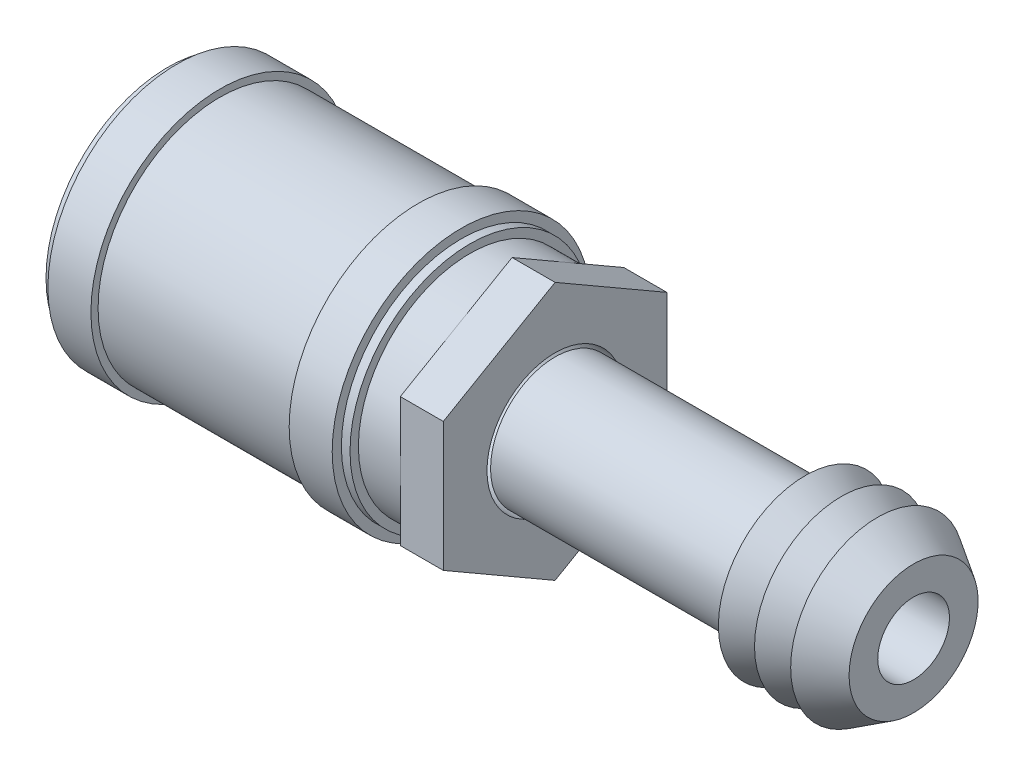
ISO-10303-21;
HEADER;
FILE_DESCRIPTION(('STEP AP214'),'2;1');
FILE_NAME('part.step','',(''),(''),'','','');
FILE_SCHEMA(('AUTOMOTIVE_DESIGN { 1 0 10303 214 1 1 1 1 }'));
ENDSEC;
DATA;
#1=APPLICATION_CONTEXT('core data for automotive mechanical design processes');
#2=APPLICATION_PROTOCOL_DEFINITION('international standard','automotive_design',2000,#1);
#3=PRODUCT_CONTEXT('',#1,'mechanical');
#4=PRODUCT('Part','Part','',(#3));
#5=PRODUCT_RELATED_PRODUCT_CATEGORY('part','',(#4));
#6=PRODUCT_DEFINITION_FORMATION('','',#4);
#7=PRODUCT_DEFINITION_CONTEXT('part definition',#1,'design');
#8=PRODUCT_DEFINITION('design','',#6,#7);
#9=PRODUCT_DEFINITION_SHAPE('','',#8);
#10=(LENGTH_UNIT() NAMED_UNIT(*) SI_UNIT(.MILLI.,.METRE.));
#11=(NAMED_UNIT(*) PLANE_ANGLE_UNIT() SI_UNIT($,.RADIAN.));
#12=(NAMED_UNIT(*) SI_UNIT($,.STERADIAN.) SOLID_ANGLE_UNIT());
#13=UNCERTAINTY_MEASURE_WITH_UNIT(LENGTH_MEASURE(1.E-05),#10,'distance_accuracy_value','');
#14=(GEOMETRIC_REPRESENTATION_CONTEXT(3) GLOBAL_UNCERTAINTY_ASSIGNED_CONTEXT((#13)) GLOBAL_UNIT_ASSIGNED_CONTEXT((#10,
#11,#12)) REPRESENTATION_CONTEXT('',''));
#15=CARTESIAN_POINT('',(0.,0.,0.));
#16=DIRECTION('',(0.,0.,1.));
#17=DIRECTION('',(1.,0.,0.));
#18=AXIS2_PLACEMENT_3D('',#15,#16,#17);
#19=CARTESIAN_POINT('',(0.,0.,0.));
#20=DIRECTION('',(-1.,0.,0.));
#21=DIRECTION('',(0.,0.,1.));
#22=AXIS2_PLACEMENT_3D('',#19,#20,#21);
#23=CYLINDRICAL_SURFACE('',#22,4.75);
#24=CARTESIAN_POINT('',(0.,0.,0.));
#25=DIRECTION('',(-1.,0.,0.));
#26=DIRECTION('',(0.,0.,1.));
#27=AXIS2_PLACEMENT_3D('',#24,#25,#26);
#28=CIRCLE('',#27,4.75);
#29=CARTESIAN_POINT('',(0.,0.,4.75));
#30=VERTEX_POINT('',#29);
#31=EDGE_CURVE('P0_E123',#30,#30,#28,.T.);
#32=ORIENTED_EDGE('',*,*,#31,.T.);
#33=EDGE_LOOP('',(#32));
#34=FACE_BOUND('',#33,.T.);
#35=CARTESIAN_POINT('',(27.,0.,0.));
#36=DIRECTION('',(1.,0.,0.));
#37=DIRECTION('',(0.,0.,-1.));
#38=AXIS2_PLACEMENT_3D('',#35,#36,#37);
#39=CIRCLE('',#38,4.75);
#40=CARTESIAN_POINT('',(27.,0.,-4.75));
#41=VERTEX_POINT('',#40);
#42=EDGE_CURVE('P0_E107',#41,#41,#39,.T.);
#43=ORIENTED_EDGE('',*,*,#42,.T.);
#44=EDGE_LOOP('',(#43));
#45=FACE_BOUND('',#44,.T.);
#46=ADVANCED_FACE('P0_F16',(#34,#45),#23,.F.);
#47=CARTESIAN_POINT('',(0.,0.,0.));
#48=DIRECTION('',(-1.,0.,0.));
#49=DIRECTION('',(0.,0.,1.));
#50=AXIS2_PLACEMENT_3D('',#47,#48,#49);
#51=CYLINDRICAL_SURFACE('',#50,7.77632073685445);
#52=CARTESIAN_POINT('',(21.0601182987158,0.,0.));
#53=DIRECTION('',(-1.,0.,0.));
#54=DIRECTION('',(0.,0.,1.));
#55=AXIS2_PLACEMENT_3D('',#52,#53,#54);
#56=CIRCLE('',#55,7.77632073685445);
#57=CARTESIAN_POINT('',(21.0601182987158,0.,7.77632073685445));
#58=VERTEX_POINT('',#57);
#59=EDGE_CURVE('P0_E10',#58,#58,#56,.T.);
#60=ORIENTED_EDGE('',*,*,#59,.F.);
#61=EDGE_LOOP('',(#60));
#62=FACE_BOUND('',#61,.T.);
#63=CARTESIAN_POINT('',(24.,0.,0.));
#64=DIRECTION('',(-1.,0.,0.));
#65=DIRECTION('',(0.,0.,1.));
#66=AXIS2_PLACEMENT_3D('',#63,#64,#65);
#67=CIRCLE('',#66,7.77632073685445);
#68=CARTESIAN_POINT('',(24.,0.,7.77632073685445));
#69=VERTEX_POINT('',#68);
#70=EDGE_CURVE('P0_E19',#69,#69,#67,.T.);
#71=ORIENTED_EDGE('',*,*,#70,.T.);
#72=EDGE_LOOP('',(#71));
#73=FACE_BOUND('',#72,.T.);
#74=ADVANCED_FACE('P0_F161',(#62,#73),#51,.T.);
#75=CARTESIAN_POINT('',(21.0601182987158,8.36008457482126,0.));
#76=DIRECTION('',(-1.,0.,0.));
#77=DIRECTION('',(0.,0.,1.));
#78=AXIS2_PLACEMENT_3D('',#75,#76,#77);
#79=PLANE('',#78);
#80=CARTESIAN_POINT('',(21.0601182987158,0.,0.));
#81=DIRECTION('',(-1.,0.,0.));
#82=DIRECTION('',(0.,0.,1.));
#83=AXIS2_PLACEMENT_3D('',#80,#81,#82);
#84=CIRCLE('',#83,8.36008457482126);
#85=CARTESIAN_POINT('',(21.0601182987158,0.,8.36008457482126));
#86=VERTEX_POINT('',#85);
#87=EDGE_CURVE('P0_E25',#86,#86,#84,.T.);
#88=ORIENTED_EDGE('',*,*,#87,.F.);
#89=EDGE_LOOP('',(#88));
#90=FACE_BOUND('',#89,.T.);
#91=ORIENTED_EDGE('',*,*,#59,.T.);
#92=EDGE_LOOP('',(#91));
#93=FACE_BOUND('',#92,.T.);
#94=ADVANCED_FACE('P0_F158',(#90,#93),#79,.F.);
#95=CARTESIAN_POINT('',(0.,0.,0.));
#96=DIRECTION('',(-1.,0.,0.));
#97=DIRECTION('',(0.,0.,1.));
#98=AXIS2_PLACEMENT_3D('',#95,#96,#97);
#99=CYLINDRICAL_SURFACE('',#98,8.36008457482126);
#100=CARTESIAN_POINT('',(20.4570626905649,0.,0.));
#101=DIRECTION('',(-1.,0.,0.));
#102=DIRECTION('',(0.,0.,1.));
#103=AXIS2_PLACEMENT_3D('',#100,#101,#102);
#104=CIRCLE('',#103,8.36008457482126);
#105=CARTESIAN_POINT('',(20.4570626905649,0.,8.36008457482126));
#106=VERTEX_POINT('',#105);
#107=EDGE_CURVE('P0_E150',#106,#106,#104,.T.);
#108=ORIENTED_EDGE('',*,*,#107,.F.);
#109=EDGE_LOOP('',(#108));
#110=FACE_BOUND('',#109,.T.);
#111=ORIENTED_EDGE('',*,*,#87,.T.);
#112=EDGE_LOOP('',(#111));
#113=FACE_BOUND('',#112,.T.);
#114=ADVANCED_FACE('P0_F156',(#110,#113),#99,.T.);
#115=CARTESIAN_POINT('',(20.4570626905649,9.,0.));
#116=DIRECTION('',(-1.,0.,0.));
#117=DIRECTION('',(0.,0.,1.));
#118=AXIS2_PLACEMENT_3D('',#115,#116,#117);
#119=PLANE('',#118);
#120=CARTESIAN_POINT('',(20.4570626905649,0.,0.));
#121=DIRECTION('',(-1.,0.,0.));
#122=DIRECTION('',(0.,0.,1.));
#123=AXIS2_PLACEMENT_3D('',#120,#121,#122);
#124=CIRCLE('',#123,9.);
#125=CARTESIAN_POINT('',(20.4570626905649,0.,9.));
#126=VERTEX_POINT('',#125);
#127=EDGE_CURVE('P0_E147',#126,#126,#124,.T.);
#128=ORIENTED_EDGE('',*,*,#127,.F.);
#129=EDGE_LOOP('',(#128));
#130=FACE_BOUND('',#129,.T.);
#131=ORIENTED_EDGE('',*,*,#107,.T.);
#132=EDGE_LOOP('',(#131));
#133=FACE_BOUND('',#132,.T.);
#134=ADVANCED_FACE('P0_F247',(#130,#133),#119,.F.);
#135=CARTESIAN_POINT('',(0.,0.,0.));
#136=DIRECTION('',(-1.,0.,0.));
#137=DIRECTION('',(0.,0.,1.));
#138=AXIS2_PLACEMENT_3D('',#135,#136,#137);
#139=CYLINDRICAL_SURFACE('',#138,9.);
#140=CARTESIAN_POINT('',(17.4570626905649,0.,0.));
#141=DIRECTION('',(-1.,0.,0.));
#142=DIRECTION('',(0.,0.,1.));
#143=AXIS2_PLACEMENT_3D('',#140,#141,#142);
#144=CIRCLE('',#143,9.);
#145=CARTESIAN_POINT('',(17.4570626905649,0.,9.));
#146=VERTEX_POINT('',#145);
#147=EDGE_CURVE('P0_E144',#146,#146,#144,.T.);
#148=ORIENTED_EDGE('',*,*,#147,.F.);
#149=EDGE_LOOP('',(#148));
#150=FACE_BOUND('',#149,.T.);
#151=ORIENTED_EDGE('',*,*,#127,.T.);
#152=EDGE_LOOP('',(#151));
#153=FACE_BOUND('',#152,.T.);
#154=ADVANCED_FACE('P0_F243',(#150,#153),#139,.T.);
#155=CARTESIAN_POINT('',(17.4570626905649,8.5,0.));
#156=DIRECTION('',(1.,0.,0.));
#157=DIRECTION('',(0.,0.,-1.));
#158=AXIS2_PLACEMENT_3D('',#155,#156,#157);
#159=PLANE('',#158);
#160=CARTESIAN_POINT('',(17.4570626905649,0.,0.));
#161=DIRECTION('',(-1.,0.,0.));
#162=DIRECTION('',(0.,0.,1.));
#163=AXIS2_PLACEMENT_3D('',#160,#161,#162);
#164=CIRCLE('',#163,8.5);
#165=CARTESIAN_POINT('',(17.4570626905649,0.,8.5));
#166=VERTEX_POINT('',#165);
#167=EDGE_CURVE('P0_E141',#166,#166,#164,.T.);
#168=ORIENTED_EDGE('',*,*,#167,.F.);
#169=EDGE_LOOP('',(#168));
#170=FACE_BOUND('',#169,.T.);
#171=ORIENTED_EDGE('',*,*,#147,.T.);
#172=EDGE_LOOP('',(#171));
#173=FACE_BOUND('',#172,.T.);
#174=ADVANCED_FACE('P0_F239',(#170,#173),#159,.F.);
#175=CARTESIAN_POINT('',(0.,0.,0.));
#176=DIRECTION('',(-1.,0.,0.));
#177=DIRECTION('',(0.,0.,1.));
#178=AXIS2_PLACEMENT_3D('',#175,#176,#177);
#179=CYLINDRICAL_SURFACE('',#178,8.5);
#180=CARTESIAN_POINT('',(3.63147282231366,0.,0.));
#181=DIRECTION('',(-1.,0.,0.));
#182=DIRECTION('',(0.,0.,1.));
#183=AXIS2_PLACEMENT_3D('',#180,#181,#182);
#184=CIRCLE('',#183,8.5);
#185=CARTESIAN_POINT('',(3.63147282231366,0.,8.5));
#186=VERTEX_POINT('',#185);
#187=EDGE_CURVE('P0_E138',#186,#186,#184,.T.);
#188=ORIENTED_EDGE('',*,*,#187,.F.);
#189=EDGE_LOOP('',(#188));
#190=FACE_BOUND('',#189,.T.);
#191=ORIENTED_EDGE('',*,*,#167,.T.);
#192=EDGE_LOOP('',(#191));
#193=FACE_BOUND('',#192,.T.);
#194=ADVANCED_FACE('P0_F235',(#190,#193),#179,.T.);
#195=CARTESIAN_POINT('',(3.63147282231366,9.,0.));
#196=DIRECTION('',(-1.,0.,0.));
#197=DIRECTION('',(0.,0.,1.));
#198=AXIS2_PLACEMENT_3D('',#195,#196,#197);
#199=PLANE('',#198);
#200=CARTESIAN_POINT('',(3.63147282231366,0.,0.));
#201=DIRECTION('',(-1.,0.,0.));
#202=DIRECTION('',(0.,0.,1.));
#203=AXIS2_PLACEMENT_3D('',#200,#201,#202);
#204=CIRCLE('',#203,9.);
#205=CARTESIAN_POINT('',(3.63147282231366,0.,9.));
#206=VERTEX_POINT('',#205);
#207=EDGE_CURVE('P0_E135',#206,#206,#204,.T.);
#208=ORIENTED_EDGE('',*,*,#207,.F.);
#209=EDGE_LOOP('',(#208));
#210=FACE_BOUND('',#209,.T.);
#211=ORIENTED_EDGE('',*,*,#187,.T.);
#212=EDGE_LOOP('',(#211));
#213=FACE_BOUND('',#212,.T.);
#214=ADVANCED_FACE('P0_F231',(#210,#213),#199,.F.);
#215=CARTESIAN_POINT('',(0.,0.,0.));
#216=DIRECTION('',(-1.,0.,0.));
#217=DIRECTION('',(0.,0.,1.));
#218=AXIS2_PLACEMENT_3D('',#215,#216,#217);
#219=CYLINDRICAL_SURFACE('',#218,9.);
#220=CARTESIAN_POINT('',(0.631472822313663,0.,0.));
#221=DIRECTION('',(-1.,0.,0.));
#222=DIRECTION('',(0.,0.,1.));
#223=AXIS2_PLACEMENT_3D('',#220,#221,#222);
#224=CIRCLE('',#223,9.);
#225=CARTESIAN_POINT('',(0.631472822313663,0.,9.));
#226=VERTEX_POINT('',#225);
#227=EDGE_CURVE('P0_E132',#226,#226,#224,.T.);
#228=ORIENTED_EDGE('',*,*,#227,.F.);
#229=EDGE_LOOP('',(#228));
#230=FACE_BOUND('',#229,.T.);
#231=ORIENTED_EDGE('',*,*,#207,.T.);
#232=EDGE_LOOP('',(#231));
#233=FACE_BOUND('',#232,.T.);
#234=ADVANCED_FACE('P0_F227',(#230,#233),#219,.T.);
#235=CARTESIAN_POINT('',(0.631472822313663,8.5,0.));
#236=DIRECTION('',(1.,0.,0.));
#237=DIRECTION('',(0.,0.,-1.));
#238=AXIS2_PLACEMENT_3D('',#235,#236,#237);
#239=PLANE('',#238);
#240=CARTESIAN_POINT('',(0.631472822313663,0.,0.));
#241=DIRECTION('',(-1.,0.,0.));
#242=DIRECTION('',(0.,0.,1.));
#243=AXIS2_PLACEMENT_3D('',#240,#241,#242);
#244=CIRCLE('',#243,8.5);
#245=CARTESIAN_POINT('',(0.631472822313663,0.,8.5));
#246=VERTEX_POINT('',#245);
#247=EDGE_CURVE('P0_E129',#246,#246,#244,.T.);
#248=ORIENTED_EDGE('',*,*,#247,.F.);
#249=EDGE_LOOP('',(#248));
#250=FACE_BOUND('',#249,.T.);
#251=ORIENTED_EDGE('',*,*,#227,.T.);
#252=EDGE_LOOP('',(#251));
#253=FACE_BOUND('',#252,.T.);
#254=ADVANCED_FACE('P0_F223',(#250,#253),#239,.F.);
#255=CARTESIAN_POINT('',(0.,0.,0.));
#256=DIRECTION('',(-1.,0.,0.));
#257=DIRECTION('',(0.,0.,1.));
#258=AXIS2_PLACEMENT_3D('',#255,#256,#257);
#259=CYLINDRICAL_SURFACE('',#258,8.5);
#260=CARTESIAN_POINT('',(0.,0.,0.));
#261=DIRECTION('',(-1.,0.,0.));
#262=DIRECTION('',(0.,0.,1.));
#263=AXIS2_PLACEMENT_3D('',#260,#261,#262);
#264=CIRCLE('',#263,8.5);
#265=CARTESIAN_POINT('',(0.,0.,8.5));
#266=VERTEX_POINT('',#265);
#267=EDGE_CURVE('P0_E126',#266,#266,#264,.T.);
#268=ORIENTED_EDGE('',*,*,#267,.F.);
#269=EDGE_LOOP('',(#268));
#270=FACE_BOUND('',#269,.T.);
#271=ORIENTED_EDGE('',*,*,#247,.T.);
#272=EDGE_LOOP('',(#271));
#273=FACE_BOUND('',#272,.T.);
#274=ADVANCED_FACE('P0_F219',(#270,#273),#259,.T.);
#275=CARTESIAN_POINT('',(0.,4.75,0.));
#276=DIRECTION('',(1.,0.,0.));
#277=DIRECTION('',(0.,0.,-1.));
#278=AXIS2_PLACEMENT_3D('',#275,#276,#277);
#279=PLANE('',#278);
#280=ORIENTED_EDGE('',*,*,#31,.F.);
#281=EDGE_LOOP('',(#280));
#282=FACE_BOUND('',#281,.T.);
#283=ORIENTED_EDGE('',*,*,#267,.T.);
#284=EDGE_LOOP('',(#283));
#285=FACE_BOUND('',#284,.T.);
#286=ADVANCED_FACE('P0_F216',(#282,#285),#279,.F.);
#287=CARTESIAN_POINT('',(27.,0.,0.));
#288=DIRECTION('',(1.,0.,0.));
#289=DIRECTION('',(0.,0.,-1.));
#290=AXIS2_PLACEMENT_3D('',#287,#288,#289);
#291=PLANE('',#290);
#292=DIRECTION('',(0.,0.5,0.866025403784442));
#293=VECTOR('',#292,1.);
#294=CARTESIAN_POINT('',(27.,4.50000000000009,-7.7942286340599));
#295=LINE('',#294,#293);
#296=CARTESIAN_POINT('',(27.,4.50000000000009,-7.7942286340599));
#297=VERTEX_POINT('',#296);
#298=CARTESIAN_POINT('',(27.,9.,0.));
#299=VERTEX_POINT('',#298);
#300=EDGE_CURVE('P0_E114',#297,#299,#295,.T.);
#301=ORIENTED_EDGE('',*,*,#300,.T.);
#302=DIRECTION('',(0.,-0.5,0.866025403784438));
#303=VECTOR('',#302,1.);
#304=CARTESIAN_POINT('',(27.,9.,0.));
#305=LINE('',#304,#303);
#306=CARTESIAN_POINT('',(27.,4.5,7.79422863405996));
#307=VERTEX_POINT('',#306);
#308=EDGE_CURVE('P0_E71',#299,#307,#305,.T.);
#309=ORIENTED_EDGE('',*,*,#308,.T.);
#310=DIRECTION('',(0.,-1.,0.));
#311=VECTOR('',#310,1.);
#312=CARTESIAN_POINT('',(27.,4.5,7.79422863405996));
#313=LINE('',#312,#311);
#314=CARTESIAN_POINT('',(27.,-4.5,7.79422863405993));
#315=VERTEX_POINT('',#314);
#316=EDGE_CURVE('P0_E85',#307,#315,#313,.T.);
#317=ORIENTED_EDGE('',*,*,#316,.T.);
#318=DIRECTION('',(0.,-0.5,-0.866025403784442));
#319=VECTOR('',#318,1.);
#320=CARTESIAN_POINT('',(27.,-4.5,7.79422863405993));
#321=LINE('',#320,#319);
#322=CARTESIAN_POINT('',(27.,-9.,0.));
#323=VERTEX_POINT('',#322);
#324=EDGE_CURVE('P0_E78',#315,#323,#321,.T.);
#325=ORIENTED_EDGE('',*,*,#324,.T.);
#326=DIRECTION('',(0.,0.500000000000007,-0.866025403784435));
#327=VECTOR('',#326,1.);
#328=CARTESIAN_POINT('',(27.,-9.,0.));
#329=LINE('',#328,#327);
#330=CARTESIAN_POINT('',(27.,-4.49999999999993,-7.79422863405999));
#331=VERTEX_POINT('',#330);
#332=EDGE_CURVE('P0_E83',#323,#331,#329,.T.);
#333=ORIENTED_EDGE('',*,*,#332,.T.);
#334=DIRECTION('',(0.,1.,0.));
#335=VECTOR('',#334,1.);
#336=CARTESIAN_POINT('',(27.,-4.49999999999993,-7.79422863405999));
#337=LINE('',#336,#335);
#338=EDGE_CURVE('P0_E33',#331,#297,#337,.T.);
#339=ORIENTED_EDGE('',*,*,#338,.T.);
#340=EDGE_LOOP('',(#301,#309,#317,#325,#333,#339));
#341=FACE_BOUND('',#340,.T.);
#342=ORIENTED_EDGE('',*,*,#42,.F.);
#343=EDGE_LOOP('',(#342));
#344=FACE_BOUND('',#343,.T.);
#345=ADVANCED_FACE('P0_F80',(#341,#344),#291,.T.);
#346=CARTESIAN_POINT('',(24.,0.,0.));
#347=DIRECTION('',(1.,0.,0.));
#348=DIRECTION('',(0.,0.,-1.));
#349=AXIS2_PLACEMENT_3D('',#346,#347,#348);
#350=PLANE('',#349);
#351=ORIENTED_EDGE('',*,*,#70,.F.);
#352=EDGE_LOOP('',(#351));
#353=FACE_BOUND('',#352,.T.);
#354=DIRECTION('',(0.,0.5,0.866025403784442));
#355=VECTOR('',#354,1.);
#356=CARTESIAN_POINT('',(24.,4.50000000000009,-7.7942286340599));
#357=LINE('',#356,#355);
#358=CARTESIAN_POINT('',(24.,4.50000000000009,-7.7942286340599));
#359=VERTEX_POINT('',#358);
#360=CARTESIAN_POINT('',(24.,9.,0.));
#361=VERTEX_POINT('',#360);
#362=EDGE_CURVE('P0_E103',#359,#361,#357,.T.);
#363=ORIENTED_EDGE('',*,*,#362,.F.);
#364=DIRECTION('',(0.,1.,0.));
#365=VECTOR('',#364,1.);
#366=CARTESIAN_POINT('',(24.,-4.49999999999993,-7.79422863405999));
#367=LINE('',#366,#365);
#368=CARTESIAN_POINT('',(24.,-4.49999999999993,-7.79422863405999));
#369=VERTEX_POINT('',#368);
#370=EDGE_CURVE('P0_E62',#369,#359,#367,.T.);
#371=ORIENTED_EDGE('',*,*,#370,.F.);
#372=DIRECTION('',(0.,0.500000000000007,-0.866025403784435));
#373=VECTOR('',#372,1.);
#374=CARTESIAN_POINT('',(24.,-9.,0.));
#375=LINE('',#374,#373);
#376=CARTESIAN_POINT('',(24.,-9.,0.));
#377=VERTEX_POINT('',#376);
#378=EDGE_CURVE('P0_E56',#377,#369,#375,.T.);
#379=ORIENTED_EDGE('',*,*,#378,.F.);
#380=DIRECTION('',(0.,-0.5,-0.866025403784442));
#381=VECTOR('',#380,1.);
#382=CARTESIAN_POINT('',(24.,-4.5,7.79422863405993));
#383=LINE('',#382,#381);
#384=CARTESIAN_POINT('',(24.,-4.5,7.79422863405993));
#385=VERTEX_POINT('',#384);
#386=EDGE_CURVE('P0_E93',#385,#377,#383,.T.);
#387=ORIENTED_EDGE('',*,*,#386,.F.);
#388=DIRECTION('',(0.,-1.,0.));
#389=VECTOR('',#388,1.);
#390=CARTESIAN_POINT('',(24.,4.5,7.79422863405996));
#391=LINE('',#390,#389);
#392=CARTESIAN_POINT('',(24.,4.5,7.79422863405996));
#393=VERTEX_POINT('',#392);
#394=EDGE_CURVE('P0_E109',#393,#385,#391,.T.);
#395=ORIENTED_EDGE('',*,*,#394,.F.);
#396=DIRECTION('',(0.,-0.5,0.866025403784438));
#397=VECTOR('',#396,1.);
#398=CARTESIAN_POINT('',(24.,9.,0.));
#399=LINE('',#398,#397);
#400=EDGE_CURVE('P0_E106',#361,#393,#399,.T.);
#401=ORIENTED_EDGE('',*,*,#400,.F.);
#402=EDGE_LOOP('',(#363,#371,#379,#387,#395,#401));
#403=FACE_BOUND('',#402,.T.);
#404=ADVANCED_FACE('P0_F170',(#353,#403),#350,.F.);
#405=CARTESIAN_POINT('',(27.,4.50000000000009,-7.7942286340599));
#406=DIRECTION('',(0.,-0.866025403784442,0.5));
#407=DIRECTION('',(0.,-0.5,-0.866025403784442));
#408=AXIS2_PLACEMENT_3D('',#405,#406,#407);
#409=PLANE('',#408);
#410=ORIENTED_EDGE('',*,*,#362,.T.);
#411=DIRECTION('',(-1.,0.,0.));
#412=VECTOR('',#411,1.);
#413=CARTESIAN_POINT('',(27.,9.,0.));
#414=LINE('',#413,#412);
#415=EDGE_CURVE('P0_E121',#299,#361,#414,.T.);
#416=ORIENTED_EDGE('',*,*,#415,.F.);
#417=ORIENTED_EDGE('',*,*,#300,.F.);
#418=DIRECTION('',(-1.,0.,0.));
#419=VECTOR('',#418,1.);
#420=CARTESIAN_POINT('',(27.,4.50000000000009,-7.7942286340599));
#421=LINE('',#420,#419);
#422=EDGE_CURVE('P0_E99',#297,#359,#421,.T.);
#423=ORIENTED_EDGE('',*,*,#422,.T.);
#424=EDGE_LOOP('',(#410,#416,#417,#423));
#425=FACE_BOUND('',#424,.T.);
#426=ADVANCED_FACE('P0_F173',(#425),#409,.F.);
#427=CARTESIAN_POINT('',(27.,9.,0.));
#428=DIRECTION('',(0.,-0.866025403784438,-0.5));
#429=DIRECTION('',(0.,0.5,-0.866025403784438));
#430=AXIS2_PLACEMENT_3D('',#427,#428,#429);
#431=PLANE('',#430);
#432=ORIENTED_EDGE('',*,*,#400,.T.);
#433=DIRECTION('',(-1.,0.,0.));
#434=VECTOR('',#433,1.);
#435=CARTESIAN_POINT('',(27.,4.5,7.79422863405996));
#436=LINE('',#435,#434);
#437=EDGE_CURVE('P0_E118',#307,#393,#436,.T.);
#438=ORIENTED_EDGE('',*,*,#437,.F.);
#439=ORIENTED_EDGE('',*,*,#308,.F.);
#440=ORIENTED_EDGE('',*,*,#415,.T.);
#441=EDGE_LOOP('',(#432,#438,#439,#440));
#442=FACE_BOUND('',#441,.T.);
#443=ADVANCED_FACE('P0_F201',(#442),#431,.F.);
#444=CARTESIAN_POINT('',(27.,4.5,7.79422863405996));
#445=DIRECTION('',(0.,0.,-1.));
#446=DIRECTION('',(0.,1.,0.));
#447=AXIS2_PLACEMENT_3D('',#444,#445,#446);
#448=PLANE('',#447);
#449=ORIENTED_EDGE('',*,*,#394,.T.);
#450=DIRECTION('',(-1.,0.,0.));
#451=VECTOR('',#450,1.);
#452=CARTESIAN_POINT('',(27.,-4.5,7.79422863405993));
#453=LINE('',#452,#451);
#454=EDGE_CURVE('P0_E94',#315,#385,#453,.T.);
#455=ORIENTED_EDGE('',*,*,#454,.F.);
#456=ORIENTED_EDGE('',*,*,#316,.F.);
#457=ORIENTED_EDGE('',*,*,#437,.T.);
#458=EDGE_LOOP('',(#449,#455,#456,#457));
#459=FACE_BOUND('',#458,.T.);
#460=ADVANCED_FACE('P0_F203',(#459),#448,.F.);
#461=CARTESIAN_POINT('',(27.,-4.5,7.79422863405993));
#462=DIRECTION('',(0.,0.866025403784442,-0.5));
#463=DIRECTION('',(0.,0.5,0.866025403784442));
#464=AXIS2_PLACEMENT_3D('',#461,#462,#463);
#465=PLANE('',#464);
#466=ORIENTED_EDGE('',*,*,#386,.T.);
#467=DIRECTION('',(-1.,0.,0.));
#468=VECTOR('',#467,1.);
#469=CARTESIAN_POINT('',(27.,-9.,0.));
#470=LINE('',#469,#468);
#471=EDGE_CURVE('P0_E90',#323,#377,#470,.T.);
#472=ORIENTED_EDGE('',*,*,#471,.F.);
#473=ORIENTED_EDGE('',*,*,#324,.F.);
#474=ORIENTED_EDGE('',*,*,#454,.T.);
#475=EDGE_LOOP('',(#466,#472,#473,#474));
#476=FACE_BOUND('',#475,.T.);
#477=ADVANCED_FACE('P0_F91',(#476),#465,.F.);
#478=CARTESIAN_POINT('',(27.,-9.,0.));
#479=DIRECTION('',(0.,0.866025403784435,0.500000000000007));
#480=DIRECTION('',(0.,-0.500000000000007,0.866025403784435));
#481=AXIS2_PLACEMENT_3D('',#478,#479,#480);
#482=PLANE('',#481);
#483=ORIENTED_EDGE('',*,*,#378,.T.);
#484=DIRECTION('',(-1.,0.,0.));
#485=VECTOR('',#484,1.);
#486=CARTESIAN_POINT('',(27.,-4.49999999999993,-7.79422863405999));
#487=LINE('',#486,#485);
#488=EDGE_CURVE('P0_E95',#331,#369,#487,.T.);
#489=ORIENTED_EDGE('',*,*,#488,.F.);
#490=ORIENTED_EDGE('',*,*,#332,.F.);
#491=ORIENTED_EDGE('',*,*,#471,.T.);
#492=EDGE_LOOP('',(#483,#489,#490,#491));
#493=FACE_BOUND('',#492,.T.);
#494=ADVANCED_FACE('P0_F97',(#493),#482,.F.);
#495=CARTESIAN_POINT('',(27.,-4.49999999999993,-7.79422863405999));
#496=DIRECTION('',(0.,0.,1.));
#497=DIRECTION('',(0.,-1.,0.));
#498=AXIS2_PLACEMENT_3D('',#495,#496,#497);
#499=PLANE('',#498);
#500=ORIENTED_EDGE('',*,*,#370,.T.);
#501=ORIENTED_EDGE('',*,*,#422,.F.);
#502=ORIENTED_EDGE('',*,*,#338,.F.);
#503=ORIENTED_EDGE('',*,*,#488,.T.);
#504=EDGE_LOOP('',(#500,#501,#502,#503));
#505=FACE_BOUND('',#504,.T.);
#506=ADVANCED_FACE('P0_F180',(#505),#499,.F.);
#507=CLOSED_SHELL('',(#46,#74,#94,#114,#134,#154,#174,#194,#214,#234,#254,#274,#286,#345,#404,
#426,#443,#460,#477,#494,#506));
#508=MANIFOLD_SOLID_BREP('P0_B1',#507);
#509=CARTESIAN_POINT('',(27.,0.,-4.5));
#510=DIRECTION('',(1.,0.,0.));
#511=DIRECTION('',(0.,0.,-1.));
#512=AXIS2_PLACEMENT_3D('',#509,#510,#511);
#513=PLANE('',#512);
#514=CARTESIAN_POINT('',(27.,0.,0.));
#515=DIRECTION('',(-1.,0.,0.));
#516=DIRECTION('',(0.,0.,1.));
#517=AXIS2_PLACEMENT_3D('',#514,#515,#516);
#518=CIRCLE('',#517,2.5);
#519=CARTESIAN_POINT('',(27.,0.,2.5));
#520=VERTEX_POINT('',#519);
#521=EDGE_CURVE('P1_E9',#520,#520,#518,.T.);
#522=ORIENTED_EDGE('',*,*,#521,.F.);
#523=EDGE_LOOP('',(#522));
#524=FACE_BOUND('',#523,.T.);
#525=CARTESIAN_POINT('',(27.,0.,0.));
#526=DIRECTION('',(-1.,0.,0.));
#527=DIRECTION('',(0.,0.,1.));
#528=AXIS2_PLACEMENT_3D('',#525,#526,#527);
#529=CIRCLE('',#528,4.5);
#530=CARTESIAN_POINT('',(27.,0.,4.5));
#531=VERTEX_POINT('',#530);
#532=EDGE_CURVE('P1_E48',#531,#531,#529,.T.);
#533=ORIENTED_EDGE('',*,*,#532,.T.);
#534=EDGE_LOOP('',(#533));
#535=FACE_BOUND('',#534,.T.);
#536=ADVANCED_FACE('P1_F14',(#524,#535),#513,.F.);
#537=CARTESIAN_POINT('',(0.,0.,0.));
#538=DIRECTION('',(-1.,0.,0.));
#539=DIRECTION('',(0.,0.,1.));
#540=AXIS2_PLACEMENT_3D('',#537,#538,#539);
#541=CYLINDRICAL_SURFACE('',#540,2.5);
#542=CARTESIAN_POINT('',(52.,0.,0.));
#543=DIRECTION('',(-1.,0.,0.));
#544=DIRECTION('',(0.,0.,1.));
#545=AXIS2_PLACEMENT_3D('',#542,#543,#544);
#546=CIRCLE('',#545,2.5);
#547=CARTESIAN_POINT('',(52.,0.,2.5));
#548=VERTEX_POINT('',#547);
#549=EDGE_CURVE('P1_E20',#548,#548,#546,.T.);
#550=ORIENTED_EDGE('',*,*,#549,.F.);
#551=EDGE_LOOP('',(#550));
#552=FACE_BOUND('',#551,.T.);
#553=ORIENTED_EDGE('',*,*,#521,.T.);
#554=EDGE_LOOP('',(#553));
#555=FACE_BOUND('',#554,.T.);
#556=ADVANCED_FACE('P1_F97',(#552,#555),#541,.F.);
#557=CARTESIAN_POINT('',(52.,0.,-2.5));
#558=DIRECTION('',(-1.,0.,0.));
#559=DIRECTION('',(0.,0.,1.));
#560=AXIS2_PLACEMENT_3D('',#557,#558,#559);
#561=PLANE('',#560);
#562=CARTESIAN_POINT('',(52.,0.,0.));
#563=DIRECTION('',(-1.,0.,0.));
#564=DIRECTION('',(0.,0.,1.));
#565=AXIS2_PLACEMENT_3D('',#562,#563,#564);
#566=CIRCLE('',#565,4.5);
#567=CARTESIAN_POINT('',(52.,0.,4.5));
#568=VERTEX_POINT('',#567);
#569=EDGE_CURVE('P1_E24',#568,#568,#566,.T.);
#570=ORIENTED_EDGE('',*,*,#569,.F.);
#571=EDGE_LOOP('',(#570));
#572=FACE_BOUND('',#571,.T.);
#573=ORIENTED_EDGE('',*,*,#549,.T.);
#574=EDGE_LOOP('',(#573));
#575=FACE_BOUND('',#574,.T.);
#576=ADVANCED_FACE('P1_F92',(#572,#575),#561,.F.);
#577=CARTESIAN_POINT('',(52.,0.,0.));
#578=DIRECTION('',(-1.,0.,0.));
#579=DIRECTION('',(0.,0.,1.));
#580=AXIS2_PLACEMENT_3D('',#577,#578,#579);
#581=CONICAL_SURFACE('',#580,4.5,0.55169643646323);
#582=CARTESIAN_POINT('',(49.4791816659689,0.,0.));
#583=DIRECTION('',(-1.,0.,0.));
#584=DIRECTION('',(0.,0.,1.));
#585=AXIS2_PLACEMENT_3D('',#582,#583,#584);
#586=CIRCLE('',#585,6.05141689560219);
#587=CARTESIAN_POINT('',(49.4791816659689,0.,6.05141689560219));
#588=VERTEX_POINT('',#587);
#589=EDGE_CURVE('P1_E28',#588,#588,#586,.T.);
#590=ORIENTED_EDGE('',*,*,#589,.F.);
#591=EDGE_LOOP('',(#590));
#592=FACE_BOUND('',#591,.T.);
#593=ORIENTED_EDGE('',*,*,#569,.T.);
#594=EDGE_LOOP('',(#593));
#595=FACE_BOUND('',#594,.T.);
#596=ADVANCED_FACE('P1_F86',(#592,#595),#581,.T.);
#597=CARTESIAN_POINT('',(49.4791816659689,0.,-6.05141689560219));
#598=DIRECTION('',(1.,0.,0.));
#599=DIRECTION('',(0.,0.,-1.));
#600=AXIS2_PLACEMENT_3D('',#597,#598,#599);
#601=PLANE('',#600);
#602=CARTESIAN_POINT('',(49.4791816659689,0.,0.));
#603=DIRECTION('',(-1.,0.,0.));
#604=DIRECTION('',(0.,0.,1.));
#605=AXIS2_PLACEMENT_3D('',#602,#603,#604);
#606=CIRCLE('',#605,4.5);
#607=CARTESIAN_POINT('',(49.4791816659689,0.,4.5));
#608=VERTEX_POINT('',#607);
#609=EDGE_CURVE('P1_E33',#608,#608,#606,.T.);
#610=ORIENTED_EDGE('',*,*,#609,.F.);
#611=EDGE_LOOP('',(#610));
#612=FACE_BOUND('',#611,.T.);
#613=ORIENTED_EDGE('',*,*,#589,.T.);
#614=EDGE_LOOP('',(#613));
#615=FACE_BOUND('',#614,.T.);
#616=ADVANCED_FACE('P1_F80',(#612,#615),#601,.F.);
#617=CARTESIAN_POINT('',(49.4791816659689,0.,0.));
#618=DIRECTION('',(-1.,0.,0.));
#619=DIRECTION('',(0.,0.,1.));
#620=AXIS2_PLACEMENT_3D('',#617,#618,#619);
#621=CONICAL_SURFACE('',#620,4.5,0.55169643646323);
#622=CARTESIAN_POINT('',(46.9583633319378,0.,0.));
#623=DIRECTION('',(-1.,0.,0.));
#624=DIRECTION('',(0.,0.,1.));
#625=AXIS2_PLACEMENT_3D('',#622,#623,#624);
#626=CIRCLE('',#625,6.05141689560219);
#627=CARTESIAN_POINT('',(46.9583633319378,0.,6.05141689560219));
#628=VERTEX_POINT('',#627);
#629=EDGE_CURVE('P1_E36',#628,#628,#626,.T.);
#630=ORIENTED_EDGE('',*,*,#629,.F.);
#631=EDGE_LOOP('',(#630));
#632=FACE_BOUND('',#631,.T.);
#633=ORIENTED_EDGE('',*,*,#609,.T.);
#634=EDGE_LOOP('',(#633));
#635=FACE_BOUND('',#634,.T.);
#636=ADVANCED_FACE('P1_F74',(#632,#635),#621,.T.);
#637=CARTESIAN_POINT('',(46.9583633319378,0.,-6.05141689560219));
#638=DIRECTION('',(1.,0.,0.));
#639=DIRECTION('',(0.,0.,-1.));
#640=AXIS2_PLACEMENT_3D('',#637,#638,#639);
#641=PLANE('',#640);
#642=CARTESIAN_POINT('',(46.9583633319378,0.,0.));
#643=DIRECTION('',(-1.,0.,0.));
#644=DIRECTION('',(0.,0.,1.));
#645=AXIS2_PLACEMENT_3D('',#642,#643,#644);
#646=CIRCLE('',#645,4.5);
#647=CARTESIAN_POINT('',(46.9583633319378,0.,4.5));
#648=VERTEX_POINT('',#647);
#649=EDGE_CURVE('P1_E39',#648,#648,#646,.T.);
#650=ORIENTED_EDGE('',*,*,#649,.F.);
#651=EDGE_LOOP('',(#650));
#652=FACE_BOUND('',#651,.T.);
#653=ORIENTED_EDGE('',*,*,#629,.T.);
#654=EDGE_LOOP('',(#653));
#655=FACE_BOUND('',#654,.T.);
#656=ADVANCED_FACE('P1_F68',(#652,#655),#641,.F.);
#657=CARTESIAN_POINT('',(46.9583633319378,0.,0.));
#658=DIRECTION('',(-1.,0.,0.));
#659=DIRECTION('',(0.,0.,1.));
#660=AXIS2_PLACEMENT_3D('',#657,#658,#659);
#661=CONICAL_SURFACE('',#660,4.5,0.55169643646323);
#662=CARTESIAN_POINT('',(44.4375449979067,0.,0.));
#663=DIRECTION('',(-1.,0.,0.));
#664=DIRECTION('',(0.,0.,1.));
#665=AXIS2_PLACEMENT_3D('',#662,#663,#664);
#666=CIRCLE('',#665,6.05141689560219);
#667=CARTESIAN_POINT('',(44.4375449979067,0.,6.05141689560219));
#668=VERTEX_POINT('',#667);
#669=EDGE_CURVE('P1_E42',#668,#668,#666,.T.);
#670=ORIENTED_EDGE('',*,*,#669,.F.);
#671=EDGE_LOOP('',(#670));
#672=FACE_BOUND('',#671,.T.);
#673=ORIENTED_EDGE('',*,*,#649,.T.);
#674=EDGE_LOOP('',(#673));
#675=FACE_BOUND('',#674,.T.);
#676=ADVANCED_FACE('P1_F62',(#672,#675),#661,.T.);
#677=CARTESIAN_POINT('',(44.4375449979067,0.,-6.05141689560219));
#678=DIRECTION('',(1.,0.,0.));
#679=DIRECTION('',(0.,0.,-1.));
#680=AXIS2_PLACEMENT_3D('',#677,#678,#679);
#681=PLANE('',#680);
#682=CARTESIAN_POINT('',(44.4375449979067,0.,0.));
#683=DIRECTION('',(-1.,0.,0.));
#684=DIRECTION('',(0.,0.,1.));
#685=AXIS2_PLACEMENT_3D('',#682,#683,#684);
#686=CIRCLE('',#685,4.5);
#687=CARTESIAN_POINT('',(44.4375449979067,0.,4.5));
#688=VERTEX_POINT('',#687);
#689=EDGE_CURVE('P1_E45',#688,#688,#686,.T.);
#690=ORIENTED_EDGE('',*,*,#689,.F.);
#691=EDGE_LOOP('',(#690));
#692=FACE_BOUND('',#691,.T.);
#693=ORIENTED_EDGE('',*,*,#669,.T.);
#694=EDGE_LOOP('',(#693));
#695=FACE_BOUND('',#694,.T.);
#696=ADVANCED_FACE('P1_F56',(#692,#695),#681,.F.);
#697=CARTESIAN_POINT('',(0.,0.,0.));
#698=DIRECTION('',(-1.,0.,0.));
#699=DIRECTION('',(0.,0.,1.));
#700=AXIS2_PLACEMENT_3D('',#697,#698,#699);
#701=CYLINDRICAL_SURFACE('',#700,4.5);
#702=ORIENTED_EDGE('',*,*,#532,.F.);
#703=EDGE_LOOP('',(#702));
#704=FACE_BOUND('',#703,.T.);
#705=ORIENTED_EDGE('',*,*,#689,.T.);
#706=EDGE_LOOP('',(#705));
#707=FACE_BOUND('',#706,.T.);
#708=ADVANCED_FACE('P1_F53',(#704,#707),#701,.T.);
#709=CLOSED_SHELL('',(#536,#556,#576,#596,#616,#636,#656,#676,#696,#708));
#710=MANIFOLD_SOLID_BREP('P1_B1',#709);
#711=ADVANCED_BREP_SHAPE_REPRESENTATION('',(#18,#508,#710),#14);
#712=SHAPE_DEFINITION_REPRESENTATION(#9,#711);
ENDSEC;
END-ISO-10303-21;
